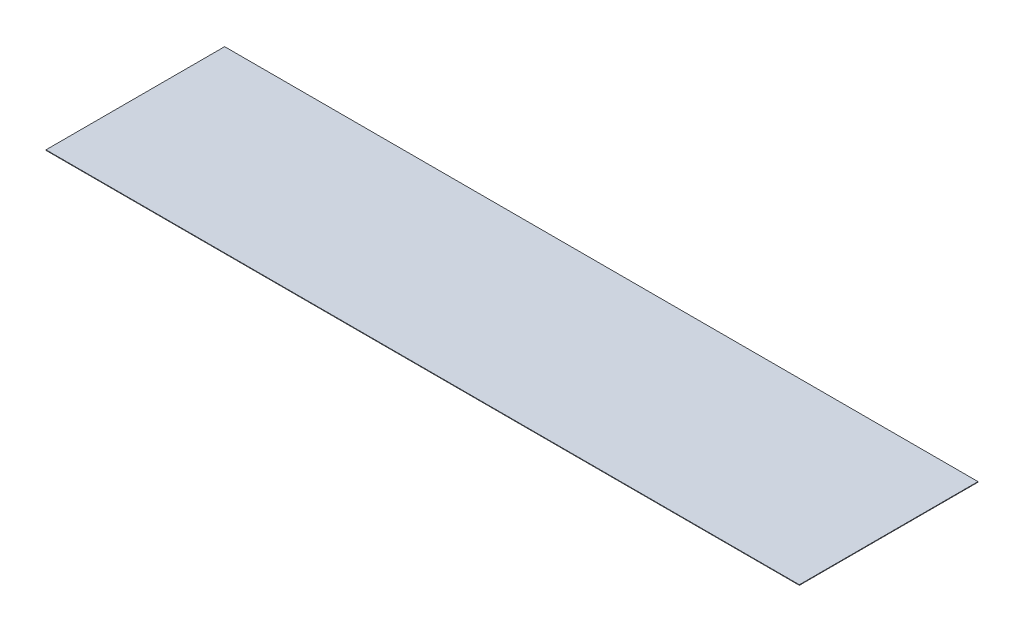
ISO-10303-21;
HEADER;
FILE_DESCRIPTION(('STEP AP214'),'2;1');
FILE_NAME('part.step','',(''),(''),'','','');
FILE_SCHEMA(('AUTOMOTIVE_DESIGN { 1 0 10303 214 1 1 1 1 }'));
ENDSEC;
DATA;
#1=APPLICATION_CONTEXT('core data for automotive mechanical design processes');
#2=APPLICATION_PROTOCOL_DEFINITION('international standard','automotive_design',2000,#1);
#3=PRODUCT_CONTEXT('',#1,'mechanical');
#4=PRODUCT('Part','Part','',(#3));
#5=PRODUCT_RELATED_PRODUCT_CATEGORY('part','',(#4));
#6=PRODUCT_DEFINITION_FORMATION('','',#4);
#7=PRODUCT_DEFINITION_CONTEXT('part definition',#1,'design');
#8=PRODUCT_DEFINITION('design','',#6,#7);
#9=PRODUCT_DEFINITION_SHAPE('','',#8);
#10=(LENGTH_UNIT() NAMED_UNIT(*) SI_UNIT(.MILLI.,.METRE.));
#11=(NAMED_UNIT(*) PLANE_ANGLE_UNIT() SI_UNIT($,.RADIAN.));
#12=(NAMED_UNIT(*) SI_UNIT($,.STERADIAN.) SOLID_ANGLE_UNIT());
#13=UNCERTAINTY_MEASURE_WITH_UNIT(LENGTH_MEASURE(1.E-05),#10,'distance_accuracy_value','');
#14=(GEOMETRIC_REPRESENTATION_CONTEXT(3) GLOBAL_UNCERTAINTY_ASSIGNED_CONTEXT((#13)) GLOBAL_UNIT_ASSIGNED_CONTEXT((#10,
#11,#12)) REPRESENTATION_CONTEXT('',''));
#15=CARTESIAN_POINT('',(0.,0.,0.));
#16=DIRECTION('',(0.,0.,1.));
#17=DIRECTION('',(1.,0.,0.));
#18=AXIS2_PLACEMENT_3D('',#15,#16,#17);
#19=CARTESIAN_POINT('',(2108.5,3.,500.));
#20=DIRECTION('',(-1.,0.,0.));
#21=DIRECTION('',(0.,0.,1.));
#22=AXIS2_PLACEMENT_3D('',#19,#20,#21);
#23=PLANE('',#22);
#24=DIRECTION('',(0.,0.,-1.));
#25=VECTOR('',#24,1.);
#26=CARTESIAN_POINT('',(2108.5,0.,500.));
#27=LINE('',#26,#25);
#28=CARTESIAN_POINT('',(2108.5,0.,500.));
#29=VERTEX_POINT('',#28);
#30=CARTESIAN_POINT('',(2108.5,0.,-500.000000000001));
#31=VERTEX_POINT('',#30);
#32=EDGE_CURVE('E96',#29,#31,#27,.T.);
#33=ORIENTED_EDGE('',*,*,#32,.T.);
#34=DIRECTION('',(0.,-1.,0.));
#35=VECTOR('',#34,1.);
#36=CARTESIAN_POINT('',(2108.5,3.,-500.000000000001));
#37=LINE('',#36,#35);
#38=CARTESIAN_POINT('',(2108.5,3.,-500.000000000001));
#39=VERTEX_POINT('',#38);
#40=EDGE_CURVE('E11',#39,#31,#37,.T.);
#41=ORIENTED_EDGE('',*,*,#40,.F.);
#42=DIRECTION('',(0.,0.,-1.));
#43=VECTOR('',#42,1.);
#44=CARTESIAN_POINT('',(2108.5,3.,500.));
#45=LINE('',#44,#43);
#46=CARTESIAN_POINT('',(2108.5,3.,500.));
#47=VERTEX_POINT('',#46);
#48=EDGE_CURVE('E84',#47,#39,#45,.T.);
#49=ORIENTED_EDGE('',*,*,#48,.F.);
#50=DIRECTION('',(0.,-1.,0.));
#51=VECTOR('',#50,1.);
#52=CARTESIAN_POINT('',(2108.5,3.,500.));
#53=LINE('',#52,#51);
#54=EDGE_CURVE('E92',#47,#29,#53,.T.);
#55=ORIENTED_EDGE('',*,*,#54,.T.);
#56=EDGE_LOOP('',(#33,#41,#49,#55));
#57=FACE_BOUND('',#56,.T.);
#58=ADVANCED_FACE('F33',(#57),#23,.F.);
#59=CARTESIAN_POINT('',(-2108.5,3.,-500.));
#60=DIRECTION('',(0.,0.,1.));
#61=DIRECTION('',(1.,0.,0.));
#62=AXIS2_PLACEMENT_3D('',#59,#60,#61);
#63=PLANE('',#62);
#64=DIRECTION('',(-1.,0.,0.));
#65=VECTOR('',#64,1.);
#66=CARTESIAN_POINT('',(-2108.5,0.,-500.));
#67=LINE('',#66,#65);
#68=CARTESIAN_POINT('',(-2108.5,0.,-500.));
#69=VERTEX_POINT('',#68);
#70=EDGE_CURVE('E88',#31,#69,#67,.T.);
#71=ORIENTED_EDGE('',*,*,#70,.T.);
#72=DIRECTION('',(0.,-1.,0.));
#73=VECTOR('',#72,1.);
#74=CARTESIAN_POINT('',(-2108.5,3.,-500.));
#75=LINE('',#74,#73);
#76=CARTESIAN_POINT('',(-2108.5,3.,-500.));
#77=VERTEX_POINT('',#76);
#78=EDGE_CURVE('E41',#77,#69,#75,.T.);
#79=ORIENTED_EDGE('',*,*,#78,.F.);
#80=DIRECTION('',(-1.,0.,0.));
#81=VECTOR('',#80,1.);
#82=CARTESIAN_POINT('',(-2108.5,3.,-500.));
#83=LINE('',#82,#81);
#84=EDGE_CURVE('E79',#39,#77,#83,.T.);
#85=ORIENTED_EDGE('',*,*,#84,.F.);
#86=ORIENTED_EDGE('',*,*,#40,.T.);
#87=EDGE_LOOP('',(#71,#79,#85,#86));
#88=FACE_BOUND('',#87,.T.);
#89=ADVANCED_FACE('F87',(#88),#63,.F.);
#90=CARTESIAN_POINT('',(-2108.5,3.,500.));
#91=DIRECTION('',(1.,0.,0.));
#92=DIRECTION('',(0.,0.,-1.));
#93=AXIS2_PLACEMENT_3D('',#90,#91,#92);
#94=PLANE('',#93);
#95=DIRECTION('',(0.,0.,1.));
#96=VECTOR('',#95,1.);
#97=CARTESIAN_POINT('',(-2108.5,0.,500.));
#98=LINE('',#97,#96);
#99=CARTESIAN_POINT('',(-2108.5,0.,500.));
#100=VERTEX_POINT('',#99);
#101=EDGE_CURVE('E66',#69,#100,#98,.T.);
#102=ORIENTED_EDGE('',*,*,#101,.T.);
#103=DIRECTION('',(0.,-1.,0.));
#104=VECTOR('',#103,1.);
#105=CARTESIAN_POINT('',(-2108.5,3.,500.));
#106=LINE('',#105,#104);
#107=CARTESIAN_POINT('',(-2108.5,3.,500.));
#108=VERTEX_POINT('',#107);
#109=EDGE_CURVE('E89',#108,#100,#106,.T.);
#110=ORIENTED_EDGE('',*,*,#109,.F.);
#111=DIRECTION('',(0.,0.,1.));
#112=VECTOR('',#111,1.);
#113=CARTESIAN_POINT('',(-2108.5,3.,500.));
#114=LINE('',#113,#112);
#115=EDGE_CURVE('E82',#77,#108,#114,.T.);
#116=ORIENTED_EDGE('',*,*,#115,.F.);
#117=ORIENTED_EDGE('',*,*,#78,.T.);
#118=EDGE_LOOP('',(#102,#110,#116,#117));
#119=FACE_BOUND('',#118,.T.);
#120=ADVANCED_FACE('F90',(#119),#94,.F.);
#121=CARTESIAN_POINT('',(-2108.5,3.,500.));
#122=DIRECTION('',(0.,0.,-1.));
#123=DIRECTION('',(-1.,0.,0.));
#124=AXIS2_PLACEMENT_3D('',#121,#122,#123);
#125=PLANE('',#124);
#126=DIRECTION('',(1.,0.,0.));
#127=VECTOR('',#126,1.);
#128=CARTESIAN_POINT('',(-2108.5,0.,500.));
#129=LINE('',#128,#127);
#130=EDGE_CURVE('E72',#100,#29,#129,.T.);
#131=ORIENTED_EDGE('',*,*,#130,.T.);
#132=ORIENTED_EDGE('',*,*,#54,.F.);
#133=DIRECTION('',(1.,0.,0.));
#134=VECTOR('',#133,1.);
#135=CARTESIAN_POINT('',(-2108.5,3.,500.));
#136=LINE('',#135,#134);
#137=EDGE_CURVE('E49',#108,#47,#136,.T.);
#138=ORIENTED_EDGE('',*,*,#137,.F.);
#139=ORIENTED_EDGE('',*,*,#109,.T.);
#140=EDGE_LOOP('',(#131,#132,#138,#139));
#141=FACE_BOUND('',#140,.T.);
#142=ADVANCED_FACE('F103',(#141),#125,.F.);
#143=CARTESIAN_POINT('',(0.,3.,0.));
#144=DIRECTION('',(0.,-1.,0.));
#145=DIRECTION('',(0.,0.,-1.));
#146=AXIS2_PLACEMENT_3D('',#143,#144,#145);
#147=PLANE('',#146);
#148=ORIENTED_EDGE('',*,*,#48,.T.);
#149=ORIENTED_EDGE('',*,*,#84,.T.);
#150=ORIENTED_EDGE('',*,*,#115,.T.);
#151=ORIENTED_EDGE('',*,*,#137,.T.);
#152=EDGE_LOOP('',(#148,#149,#150,#151));
#153=FACE_BOUND('',#152,.T.);
#154=ADVANCED_FACE('F80',(#153),#147,.F.);
#155=CARTESIAN_POINT('',(0.,0.,0.));
#156=DIRECTION('',(0.,-1.,0.));
#157=DIRECTION('',(0.,0.,-1.));
#158=AXIS2_PLACEMENT_3D('',#155,#156,#157);
#159=PLANE('',#158);
#160=ORIENTED_EDGE('',*,*,#32,.F.);
#161=ORIENTED_EDGE('',*,*,#130,.F.);
#162=ORIENTED_EDGE('',*,*,#101,.F.);
#163=ORIENTED_EDGE('',*,*,#70,.F.);
#164=EDGE_LOOP('',(#160,#161,#162,#163));
#165=FACE_BOUND('',#164,.T.);
#166=ADVANCED_FACE('F106',(#165),#159,.T.);
#167=CLOSED_SHELL('',(#58,#89,#120,#142,#154,#166));
#168=MANIFOLD_SOLID_BREP('B2',#167);
#169=ADVANCED_BREP_SHAPE_REPRESENTATION('',(#18,#168),#14);
#170=SHAPE_DEFINITION_REPRESENTATION(#9,#169);
ENDSEC;
END-ISO-10303-21;
